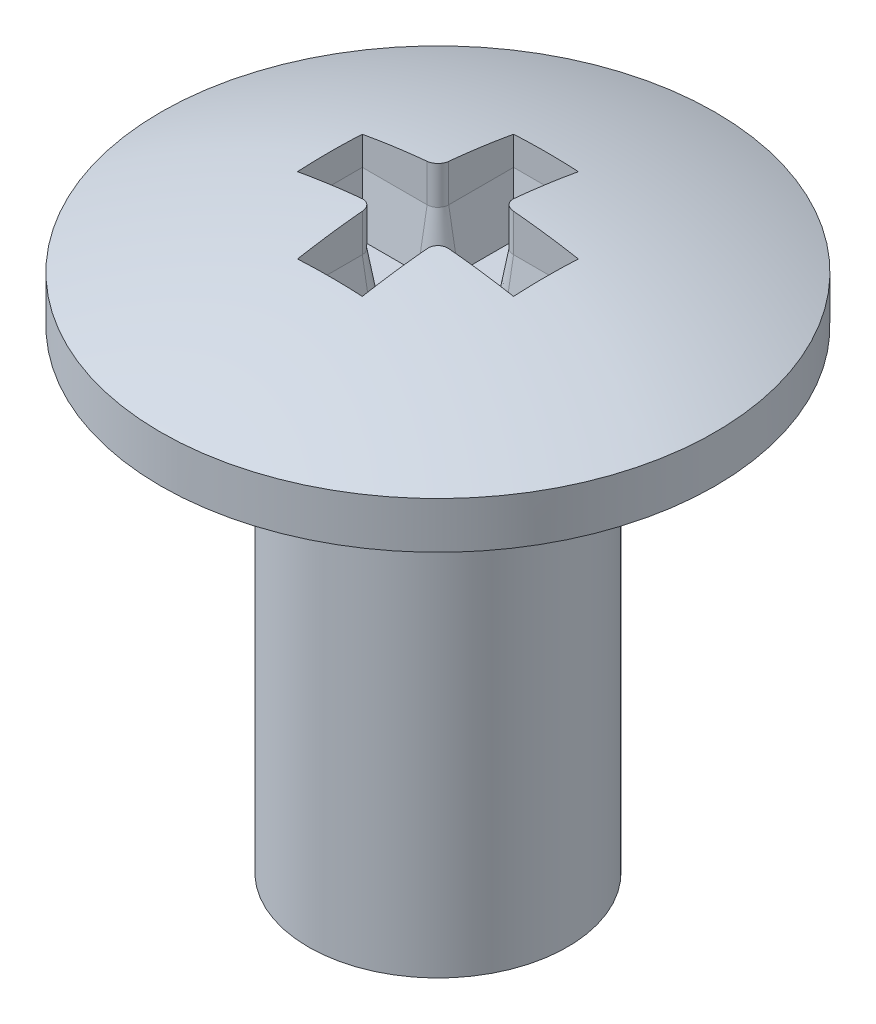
from build123d import *

# Parameters (mm, degrees)
CUT_EXTRUDE1_DEPTH           = 0.635
CUT_EXTRUDE1_TAPER           = 10
CUT_EXTRUDE1_OTHER_WAY_DEPTH = 0.635


with BuildPart() as part:
    # Sketch1 → Revolve1 (revolve)
    with BuildSketch(Plane.XY, mode=Mode.PRIVATE) as revolve1_sk:
        with BuildLine():
            Line((3.258509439, -0.788940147), (1.522346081, -0.788940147))
            Line((1.522346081, -0.788940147), (1.522346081, -6.35))
            Line((1.522346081, -6.35), (0, -6.35))
            Line((0, -6.35), (0, 0.494849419))
            ThreePointArc((0, 0.494849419), (1.661154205, 0.2678252), (3.258509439, -0.24151707))
            Line((3.258509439, -0.24151707), (3.258509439, -0.788940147))
        make_face()
    revolve(revolve1_sk.sketch.rotate(Axis((0, 1.013165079, 0), (0, 1, 0)), 90), axis=Axis((0, 1.013165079, 0), (0, 1, 0)))

    # Sketch2 → Cut-Extrude1 (cut)
    with BuildSketch(Plane(origin=(0, 0, 0), x_dir=(1, 0, 0), z_dir=(0, 1, 0))):
        with BuildLine():
            Line((-1.27, 0.381), (-1.27, -0.381))
            Line((-1.27, -0.381), (-0.508, -0.381))
            ThreePointArc((-0.508, -0.381), (-0.418197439, -0.418197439), (-0.381, -0.508))
            Line((-0.381, -0.508), (-0.381, -1.27))
            Line((-0.381, -1.27), (0.381, -1.27))
            Line((0.381, -1.27), (0.381, -0.508))
            ThreePointArc((0.381, -0.508), (0.418197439, -0.418197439), (0.508, -0.381))
            Line((0.508, -0.381), (1.27, -0.381))
            Line((1.27, -0.381), (1.27, 0.381))
            Line((1.27, 0.381), (0.508, 0.381))
            ThreePointArc((0.508, 0.381), (0.418197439, 0.418197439), (0.381, 0.508))
            Line((0.381, 0.508), (0.381, 1.27))
            Line((0.381, 1.27), (-0.381, 1.27))
            Line((-0.381, 1.27), (-0.381, 0.508))
            ThreePointArc((-0.381, 0.508), (-0.418197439, 0.418197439), (-0.508, 0.381))
            Line((-0.508, 0.381), (-1.27, 0.381))
        make_face()
    extrude(amount=-CUT_EXTRUDE1_DEPTH, taper=CUT_EXTRUDE1_TAPER, mode=Mode.SUBTRACT)

    # Sketch2 → Cut-Extrude1 other way (cut)
    with BuildSketch(Plane(origin=(0, 0, 0), x_dir=(1, 0, 0), z_dir=(0, 1, 0))):
        with BuildLine():
            Line((-1.27, 0.381), (-1.27, -0.381))
            Line((-1.27, -0.381), (-0.508, -0.381))
            ThreePointArc((-0.508, -0.381), (-0.418197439, -0.418197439), (-0.381, -0.508))
            Line((-0.381, -0.508), (-0.381, -1.27))
            Line((-0.381, -1.27), (0.381, -1.27))
            Line((0.381, -1.27), (0.381, -0.508))
            ThreePointArc((0.381, -0.508), (0.418197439, -0.418197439), (0.508, -0.381))
            Line((0.508, -0.381), (1.27, -0.381))
            Line((1.27, -0.381), (1.27, 0.381))
            Line((1.27, 0.381), (0.508, 0.381))
            ThreePointArc((0.508, 0.381), (0.418197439, 0.418197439), (0.381, 0.508))
            Line((0.381, 0.508), (0.381, 1.27))
            Line((0.381, 1.27), (-0.381, 1.27))
            Line((-0.381, 1.27), (-0.381, 0.508))
            ThreePointArc((-0.381, 0.508), (-0.418197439, 0.418197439), (-0.508, 0.381))
            Line((-0.508, 0.381), (-1.27, 0.381))
        make_face()
    extrude(amount=CUT_EXTRUDE1_OTHER_WAY_DEPTH, mode=Mode.SUBTRACT)


solid = part.part
